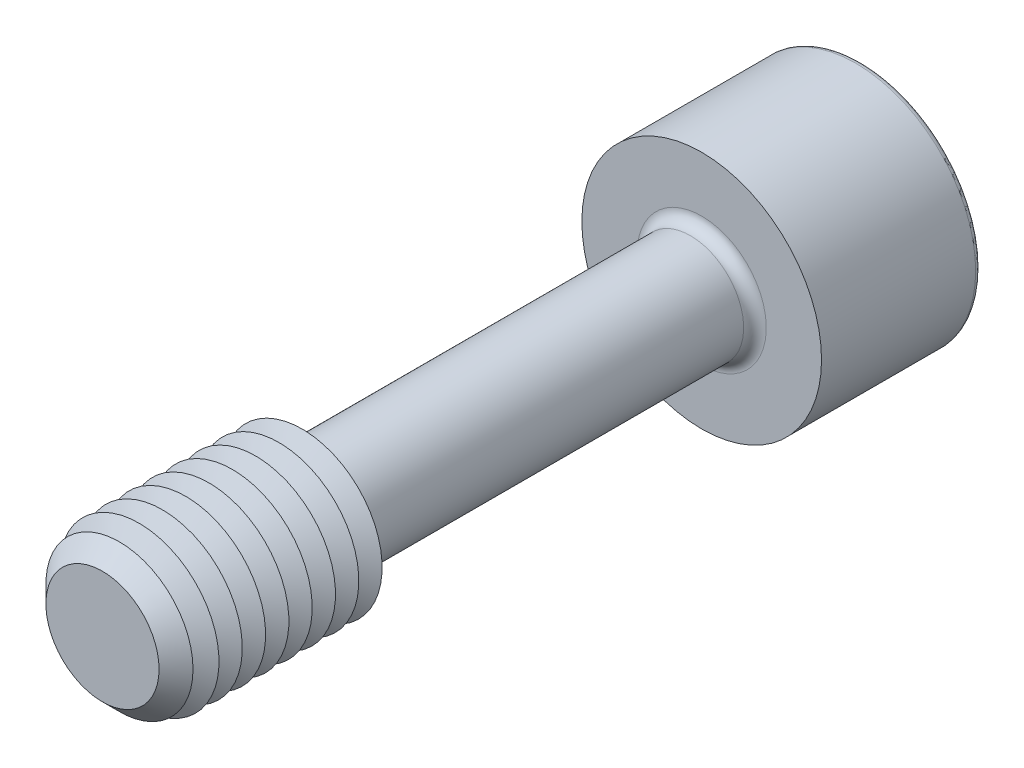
ISO-10303-21;
HEADER;
FILE_DESCRIPTION(('STEP AP214'),'2;1');
FILE_NAME('part.step','',(''),(''),'','','');
FILE_SCHEMA(('AUTOMOTIVE_DESIGN { 1 0 10303 214 1 1 1 1 }'));
ENDSEC;
DATA;
#1=APPLICATION_CONTEXT('core data for automotive mechanical design processes');
#2=APPLICATION_PROTOCOL_DEFINITION('international standard','automotive_design',2000,#1);
#3=PRODUCT_CONTEXT('',#1,'mechanical');
#4=PRODUCT('Part','Part','',(#3));
#5=PRODUCT_RELATED_PRODUCT_CATEGORY('part','',(#4));
#6=PRODUCT_DEFINITION_FORMATION('','',#4);
#7=PRODUCT_DEFINITION_CONTEXT('part definition',#1,'design');
#8=PRODUCT_DEFINITION('design','',#6,#7);
#9=PRODUCT_DEFINITION_SHAPE('','',#8);
#10=(LENGTH_UNIT() NAMED_UNIT(*) SI_UNIT(.MILLI.,.METRE.));
#11=(NAMED_UNIT(*) PLANE_ANGLE_UNIT() SI_UNIT($,.RADIAN.));
#12=(NAMED_UNIT(*) SI_UNIT($,.STERADIAN.) SOLID_ANGLE_UNIT());
#13=UNCERTAINTY_MEASURE_WITH_UNIT(LENGTH_MEASURE(1.E-05),#10,'distance_accuracy_value','');
#14=(GEOMETRIC_REPRESENTATION_CONTEXT(3) GLOBAL_UNCERTAINTY_ASSIGNED_CONTEXT((#13)) GLOBAL_UNIT_ASSIGNED_CONTEXT((#10,
#11,#12)) REPRESENTATION_CONTEXT('',''));
#15=CARTESIAN_POINT('',(0.,0.,0.));
#16=DIRECTION('',(0.,0.,1.));
#17=DIRECTION('',(1.,0.,0.));
#18=AXIS2_PLACEMENT_3D('',#15,#16,#17);
#19=CARTESIAN_POINT('',(-2.88675134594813,-5.,-24.5));
#20=DIRECTION('',(0.,0.,1.));
#21=DIRECTION('',(1.,0.,0.));
#22=AXIS2_PLACEMENT_3D('',#19,#20,#21);
#23=PLANE('',#22);
#24=DIRECTION('',(1.,0.,0.));
#25=VECTOR('',#24,1.);
#26=CARTESIAN_POINT('',(-2.88675134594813,-5.,-24.5));
#27=LINE('',#26,#25);
#28=CARTESIAN_POINT('',(0.,-5.,-24.5));
#29=VERTEX_POINT('',#28);
#30=CARTESIAN_POINT('',(2.88675134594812,-5.,-24.5));
#31=VERTEX_POINT('',#30);
#32=EDGE_CURVE('E760',#29,#31,#27,.T.);
#33=ORIENTED_EDGE('',*,*,#32,.F.);
#34=CARTESIAN_POINT('',(0.,0.,-24.5));
#35=DIRECTION('',(0.,0.,1.));
#36=DIRECTION('',(0.,-1.,0.));
#37=AXIS2_PLACEMENT_3D('',#34,#35,#36);
#38=CIRCLE('',#37,5.);
#39=CARTESIAN_POINT('',(4.3301270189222,-2.5,-24.5));
#40=VERTEX_POINT('',#39);
#41=EDGE_CURVE('E53',#29,#40,#38,.T.);
#42=ORIENTED_EDGE('',*,*,#41,.T.);
#43=DIRECTION('',(0.5,0.866025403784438,0.));
#44=VECTOR('',#43,1.);
#45=CARTESIAN_POINT('',(2.88675134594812,-5.,-24.5));
#46=LINE('',#45,#44);
#47=EDGE_CURVE('E745',#31,#40,#46,.T.);
#48=ORIENTED_EDGE('',*,*,#47,.F.);
#49=EDGE_LOOP('',(#33,#42,#48));
#50=FACE_BOUND('',#49,.T.);
#51=ADVANCED_FACE('F41',(#50),#23,.F.);
#52=CARTESIAN_POINT('',(5.77350269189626,0.,-24.5));
#53=VERTEX_POINT('',#52);
#54=EDGE_CURVE('E756',#40,#53,#46,.T.);
#55=ORIENTED_EDGE('',*,*,#54,.F.);
#56=CARTESIAN_POINT('',(4.3301270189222,2.50000000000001,-24.5));
#57=VERTEX_POINT('',#56);
#58=EDGE_CURVE('E11',#40,#57,#38,.T.);
#59=ORIENTED_EDGE('',*,*,#58,.T.);
#60=DIRECTION('',(-0.5,0.866025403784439,0.));
#61=VECTOR('',#60,1.);
#62=CARTESIAN_POINT('',(5.77350269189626,0.,-24.5));
#63=LINE('',#62,#61);
#64=EDGE_CURVE('E744',#53,#57,#63,.T.);
#65=ORIENTED_EDGE('',*,*,#64,.F.);
#66=EDGE_LOOP('',(#55,#59,#65));
#67=FACE_BOUND('',#66,.T.);
#68=ADVANCED_FACE('F133',(#67),#23,.F.);
#69=CARTESIAN_POINT('',(2.88675134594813,5.,-24.5));
#70=VERTEX_POINT('',#69);
#71=EDGE_CURVE('E740',#57,#70,#63,.T.);
#72=ORIENTED_EDGE('',*,*,#71,.F.);
#73=CARTESIAN_POINT('',(0.,5.00000000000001,-24.5));
#74=VERTEX_POINT('',#73);
#75=EDGE_CURVE('E51',#57,#74,#38,.T.);
#76=ORIENTED_EDGE('',*,*,#75,.T.);
#77=DIRECTION('',(-1.,0.,0.));
#78=VECTOR('',#77,1.);
#79=CARTESIAN_POINT('',(2.88675134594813,5.,-24.5));
#80=LINE('',#79,#78);
#81=EDGE_CURVE('E177',#70,#74,#80,.T.);
#82=ORIENTED_EDGE('',*,*,#81,.F.);
#83=EDGE_LOOP('',(#72,#76,#82));
#84=FACE_BOUND('',#83,.T.);
#85=ADVANCED_FACE('F139',(#84),#23,.F.);
#86=CARTESIAN_POINT('',(-2.88675134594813,5.,-24.5));
#87=VERTEX_POINT('',#86);
#88=EDGE_CURVE('E750',#74,#87,#80,.T.);
#89=ORIENTED_EDGE('',*,*,#88,.F.);
#90=CARTESIAN_POINT('',(-4.3301270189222,2.50000000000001,-24.5));
#91=VERTEX_POINT('',#90);
#92=EDGE_CURVE('E262',#74,#91,#38,.T.);
#93=ORIENTED_EDGE('',*,*,#92,.T.);
#94=DIRECTION('',(-0.5,-0.866025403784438,0.));
#95=VECTOR('',#94,1.);
#96=CARTESIAN_POINT('',(-2.88675134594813,5.,-24.5));
#97=LINE('',#96,#95);
#98=EDGE_CURVE('E176',#87,#91,#97,.T.);
#99=ORIENTED_EDGE('',*,*,#98,.F.);
#100=EDGE_LOOP('',(#89,#93,#99));
#101=FACE_BOUND('',#100,.T.);
#102=ADVANCED_FACE('F157',(#101),#23,.F.);
#103=CARTESIAN_POINT('',(-5.77350269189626,0.,-24.5));
#104=VERTEX_POINT('',#103);
#105=EDGE_CURVE('E170',#91,#104,#97,.T.);
#106=ORIENTED_EDGE('',*,*,#105,.F.);
#107=CARTESIAN_POINT('',(-4.3301270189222,-2.5,-24.5));
#108=VERTEX_POINT('',#107);
#109=EDGE_CURVE('E172',#91,#108,#38,.T.);
#110=ORIENTED_EDGE('',*,*,#109,.T.);
#111=DIRECTION('',(0.5,-0.866025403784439,0.));
#112=VECTOR('',#111,1.);
#113=CARTESIAN_POINT('',(-5.77350269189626,0.,-24.5));
#114=LINE('',#113,#112);
#115=EDGE_CURVE('E174',#104,#108,#114,.T.);
#116=ORIENTED_EDGE('',*,*,#115,.F.);
#117=EDGE_LOOP('',(#106,#110,#116));
#118=FACE_BOUND('',#117,.T.);
#119=ADVANCED_FACE('F146',(#118),#23,.F.);
#120=CARTESIAN_POINT('',(0.,0.,-34.5));
#121=DIRECTION('',(0.,0.,-1.));
#122=DIRECTION('',(-1.,0.,0.));
#123=AXIS2_PLACEMENT_3D('',#120,#121,#122);
#124=PLANE('',#123);
#125=CARTESIAN_POINT('',(0.,0.,-34.5));
#126=DIRECTION('',(0.,0.,-1.));
#127=DIRECTION('',(-1.,0.,0.));
#128=AXIS2_PLACEMENT_3D('',#125,#126,#127);
#129=CIRCLE('',#128,8.575);
#130=CARTESIAN_POINT('',(-8.575,0.,-34.5));
#131=VERTEX_POINT('',#130);
#132=EDGE_CURVE('E251',#131,#131,#129,.T.);
#133=ORIENTED_EDGE('',*,*,#132,.T.);
#134=EDGE_LOOP('',(#133));
#135=FACE_BOUND('',#134,.T.);
#136=DIRECTION('',(-0.5,-0.866025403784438,0.));
#137=VECTOR('',#136,1.);
#138=CARTESIAN_POINT('',(-2.88675134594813,5.,-34.5));
#139=LINE('',#138,#137);
#140=CARTESIAN_POINT('',(-2.88675134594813,5.,-34.5));
#141=VERTEX_POINT('',#140);
#142=CARTESIAN_POINT('',(-5.77350269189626,0.,-34.5));
#143=VERTEX_POINT('',#142);
#144=EDGE_CURVE('E212',#141,#143,#139,.T.);
#145=ORIENTED_EDGE('',*,*,#144,.T.);
#146=DIRECTION('',(0.5,-0.866025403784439,0.));
#147=VECTOR('',#146,1.);
#148=CARTESIAN_POINT('',(-5.77350269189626,0.,-34.5));
#149=LINE('',#148,#147);
#150=CARTESIAN_POINT('',(-2.88675134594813,-5.,-34.5));
#151=VERTEX_POINT('',#150);
#152=EDGE_CURVE('E67',#143,#151,#149,.T.);
#153=ORIENTED_EDGE('',*,*,#152,.T.);
#154=DIRECTION('',(1.,0.,0.));
#155=VECTOR('',#154,1.);
#156=CARTESIAN_POINT('',(-2.88675134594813,-5.,-34.5));
#157=LINE('',#156,#155);
#158=CARTESIAN_POINT('',(2.88675134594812,-5.,-34.5));
#159=VERTEX_POINT('',#158);
#160=EDGE_CURVE('E196',#151,#159,#157,.T.);
#161=ORIENTED_EDGE('',*,*,#160,.T.);
#162=DIRECTION('',(0.5,0.866025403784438,0.));
#163=VECTOR('',#162,1.);
#164=CARTESIAN_POINT('',(2.88675134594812,-5.,-34.5));
#165=LINE('',#164,#163);
#166=CARTESIAN_POINT('',(5.77350269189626,0.,-34.5));
#167=VERTEX_POINT('',#166);
#168=EDGE_CURVE('E200',#159,#167,#165,.T.);
#169=ORIENTED_EDGE('',*,*,#168,.T.);
#170=DIRECTION('',(-0.5,0.866025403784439,0.));
#171=VECTOR('',#170,1.);
#172=CARTESIAN_POINT('',(5.77350269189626,0.,-34.5));
#173=LINE('',#172,#171);
#174=CARTESIAN_POINT('',(2.88675134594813,5.,-34.5));
#175=VERTEX_POINT('',#174);
#176=EDGE_CURVE('E204',#167,#175,#173,.T.);
#177=ORIENTED_EDGE('',*,*,#176,.T.);
#178=DIRECTION('',(-1.,0.,0.));
#179=VECTOR('',#178,1.);
#180=CARTESIAN_POINT('',(2.88675134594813,5.,-34.5));
#181=LINE('',#180,#179);
#182=EDGE_CURVE('E208',#175,#141,#181,.T.);
#183=ORIENTED_EDGE('',*,*,#182,.T.);
#184=EDGE_LOOP('',(#145,#153,#161,#169,#177,#183));
#185=FACE_BOUND('',#184,.T.);
#186=ADVANCED_FACE('F156',(#135,#185),#124,.T.);
#187=CARTESIAN_POINT('',(0.,0.,22.5));
#188=DIRECTION('',(0.,0.,-1.));
#189=DIRECTION('',(-1.,0.,0.));
#190=AXIS2_PLACEMENT_3D('',#187,#188,#189);
#191=CYLINDRICAL_SURFACE('',#190,4.);
#192=CARTESIAN_POINT('',(0.,0.,-21.65));
#193=DIRECTION('',(0.,0.,-1.));
#194=DIRECTION('',(-1.,0.,0.));
#195=AXIS2_PLACEMENT_3D('',#192,#193,#194);
#196=CIRCLE('',#195,4.);
#197=CARTESIAN_POINT('',(-4.,0.,-21.65));
#198=VERTEX_POINT('',#197);
#199=EDGE_CURVE('E247',#198,#198,#196,.F.);
#200=CARTESIAN_POINT('',(0.,0.,6.34529946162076));
#201=DIRECTION('',(0.,0.,-1.));
#202=DIRECTION('',(0.,1.,0.));
#203=AXIS2_PLACEMENT_3D('',#200,#201,#202);
#204=CIRCLE('',#203,4.);
#205=CARTESIAN_POINT('',(-4.,0.,6.34529946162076));
#206=VERTEX_POINT('',#205);
#207=EDGE_CURVE('E235',#206,#206,#204,.T.);
#208=CARTESIAN_POINT('',(-4.,0.,-21.65));
#209=CARTESIAN_POINT('',(-4.,0.,-21.3583822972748));
#210=CARTESIAN_POINT('',(-4.,0.,-21.0667645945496));
#211=CARTESIAN_POINT('',(-4.,0.,-20.4835291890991));
#212=CARTESIAN_POINT('',(-4.,0.,-20.1919114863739));
#213=CARTESIAN_POINT('',(-4.,0.,-19.6086760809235));
#214=CARTESIAN_POINT('',(-4.,0.,-19.3170583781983));
#215=CARTESIAN_POINT('',(-4.,0.,-18.7338229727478));
#216=CARTESIAN_POINT('',(-4.,0.,-18.4422052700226));
#217=CARTESIAN_POINT('',(-4.,0.,-17.8589698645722));
#218=CARTESIAN_POINT('',(-4.,0.,-17.567352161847));
#219=CARTESIAN_POINT('',(-4.,0.,-16.9841167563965));
#220=CARTESIAN_POINT('',(-4.,0.,-16.6924990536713));
#221=CARTESIAN_POINT('',(-4.,0.,-16.1092636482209));
#222=CARTESIAN_POINT('',(-4.,0.,-15.8176459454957));
#223=CARTESIAN_POINT('',(-4.,0.,-15.2344105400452));
#224=CARTESIAN_POINT('',(-4.,0.,-14.94279283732));
#225=CARTESIAN_POINT('',(-4.,0.,-14.3595574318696));
#226=CARTESIAN_POINT('',(-4.,0.,-14.0679397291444));
#227=CARTESIAN_POINT('',(-4.,0.,-13.4847043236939));
#228=CARTESIAN_POINT('',(-4.,0.,-13.1930866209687));
#229=CARTESIAN_POINT('',(-4.,0.,-12.6098512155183));
#230=CARTESIAN_POINT('',(-4.,0.,-12.3182335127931));
#231=CARTESIAN_POINT('',(-4.,0.,-11.7349981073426));
#232=CARTESIAN_POINT('',(-4.,0.,-11.4433804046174));
#233=CARTESIAN_POINT('',(-4.,0.,-10.860144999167));
#234=CARTESIAN_POINT('',(-4.,0.,-10.5685272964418));
#235=CARTESIAN_POINT('',(-4.,0.,-9.98529189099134));
#236=CARTESIAN_POINT('',(-4.,0.,-9.69367418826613));
#237=CARTESIAN_POINT('',(-4.,0.,-9.1104387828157));
#238=CARTESIAN_POINT('',(-4.,0.,-8.81882108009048));
#239=CARTESIAN_POINT('',(-4.,0.,-8.23558567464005));
#240=CARTESIAN_POINT('',(-4.,0.,-7.94396797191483));
#241=CARTESIAN_POINT('',(-4.,0.,-7.3607325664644));
#242=CARTESIAN_POINT('',(-4.,0.,-7.06911486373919));
#243=CARTESIAN_POINT('',(-4.,0.,-6.48587945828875));
#244=CARTESIAN_POINT('',(-4.,0.,-6.19426175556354));
#245=CARTESIAN_POINT('',(-4.,0.,-5.6110263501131));
#246=CARTESIAN_POINT('',(-4.,0.,-5.31940864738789));
#247=CARTESIAN_POINT('',(-4.,0.,-4.73617324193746));
#248=CARTESIAN_POINT('',(-4.,0.,-4.44455553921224));
#249=CARTESIAN_POINT('',(-4.,0.,-3.86132013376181));
#250=CARTESIAN_POINT('',(-4.,0.,-3.56970243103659));
#251=CARTESIAN_POINT('',(-4.,0.,-2.98646702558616));
#252=CARTESIAN_POINT('',(-4.,0.,-2.69484932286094));
#253=CARTESIAN_POINT('',(-4.,0.,-2.11161391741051));
#254=CARTESIAN_POINT('',(-4.,0.,-1.81999621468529));
#255=CARTESIAN_POINT('',(-4.,0.,-1.23676080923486));
#256=CARTESIAN_POINT('',(-4.,0.,-0.945143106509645));
#257=CARTESIAN_POINT('',(-4.,0.,-0.361907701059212));
#258=CARTESIAN_POINT('',(-4.,0.,-0.0702899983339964));
#259=CARTESIAN_POINT('',(-4.,0.,0.512945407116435));
#260=CARTESIAN_POINT('',(-4.,0.,0.804563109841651));
#261=CARTESIAN_POINT('',(-4.,0.,1.38779851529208));
#262=CARTESIAN_POINT('',(-4.,0.,1.6794162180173));
#263=CARTESIAN_POINT('',(-4.,0.,2.26265162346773));
#264=CARTESIAN_POINT('',(-4.,0.,2.55426932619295));
#265=CARTESIAN_POINT('',(-4.,0.,3.13750473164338));
#266=CARTESIAN_POINT('',(-4.,0.,3.4291224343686));
#267=CARTESIAN_POINT('',(-4.,0.,4.01235783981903));
#268=CARTESIAN_POINT('',(-4.,0.,4.30397554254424));
#269=CARTESIAN_POINT('',(-4.,0.,4.88721094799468));
#270=CARTESIAN_POINT('',(-4.,0.,5.17882865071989));
#271=CARTESIAN_POINT('',(-4.,0.,5.76206405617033));
#272=CARTESIAN_POINT('',(-4.,0.,6.05368175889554));
#273=CARTESIAN_POINT('',(-4.,0.,6.34529946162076));
#274=B_SPLINE_CURVE_WITH_KNOTS('',3,(#208,#209,#210,#211,#212,#213,#214,#215,#216,#217,#218,
#219,#220,#221,#222,#223,#224,#225,#226,#227,#228,#229,#230,#231,#232,#233,#234,#235,#236,#237,
#238,#239,#240,#241,#242,#243,#244,#245,#246,#247,#248,#249,#250,#251,#252,#253,#254,#255,#256,
#257,#258,#259,#260,#261,#262,#263,#264,#265,#266,#267,#268,#269,#270,#271,#272,#273),
.UNSPECIFIED.,.F.,.F.,(4,2,2,2,2,2,2,2,2,2,2,2,2,2,2,2,2,2,2,2,2,2,2,2,2,2,2,2,2,2,2,2,4),(0.,
0.874853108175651,1.74970621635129,2.62455932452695,3.4994124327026,4.37426554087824,
5.24911864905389,6.12397175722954,6.99882486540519,7.87367797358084,8.74853108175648,
9.62338418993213,10.4982372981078,11.3730904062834,12.2479435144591,13.1227966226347,
13.9976497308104,14.872502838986,15.7473559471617,16.6222090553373,17.497062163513,
18.3719152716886,19.2467683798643,20.1216214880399,20.9964745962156,21.8713277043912,
22.7461808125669,23.6210339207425,24.4958870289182,25.3707401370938,26.2455932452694,
27.1204463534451,27.9952994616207),.UNSPECIFIED.);
#275=EDGE_CURVE('BSEAM163',#198,#206,#274,.T.);
#276=ORIENTED_EDGE('',*,*,#199,.T.);
#277=ORIENTED_EDGE('',*,*,#207,.T.);
#278=ORIENTED_EDGE('',*,*,#275,.T.);
#279=ORIENTED_EDGE('',*,*,#275,.F.);
#280=EDGE_LOOP('',(#276,#278,#277,#279));
#281=FACE_BOUND('',#280,.T.);
#282=ADVANCED_FACE('F163',(#281),#191,.T.);
#283=CARTESIAN_POINT('',(0.,0.,6.34529946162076));
#284=DIRECTION('',(0.,0.,1.));
#285=DIRECTION('',(0.,-1.,0.));
#286=AXIS2_PLACEMENT_3D('',#283,#284,#285);
#287=CONICAL_SURFACE('',#286,4.,1.0471975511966);
#288=CARTESIAN_POINT('',(0.,0.,7.5));
#289=DIRECTION('',(0.,0.,-1.));
#290=DIRECTION('',(-1.,0.,0.));
#291=AXIS2_PLACEMENT_3D('',#288,#289,#290);
#292=CIRCLE('',#291,6.);
#293=CARTESIAN_POINT('',(-6.,0.,7.5));
#294=VERTEX_POINT('',#293);
#295=EDGE_CURVE('E265',#294,#294,#292,.T.);
#296=ORIENTED_EDGE('',*,*,#295,.T.);
#297=EDGE_LOOP('',(#296));
#298=FACE_BOUND('',#297,.T.);
#299=ORIENTED_EDGE('',*,*,#207,.F.);
#300=EDGE_LOOP('',(#299));
#301=FACE_BOUND('',#300,.T.);
#302=ADVANCED_FACE('F509',(#298,#301),#287,.T.);
#303=CARTESIAN_POINT('',(0.,0.,-22.5));
#304=DIRECTION('',(0.,0.,-1.));
#305=DIRECTION('',(-1.,0.,0.));
#306=AXIS2_PLACEMENT_3D('',#303,#304,#305);
#307=PLANE('',#306);
#308=CARTESIAN_POINT('',(0.,0.,-22.5));
#309=DIRECTION('',(0.,0.,-1.));
#310=DIRECTION('',(-1.,0.,0.));
#311=AXIS2_PLACEMENT_3D('',#308,#309,#310);
#312=CIRCLE('',#311,4.85);
#313=CARTESIAN_POINT('',(-4.85,0.,-22.5));
#314=VERTEX_POINT('',#313);
#315=EDGE_CURVE('E243',#314,#314,#312,.T.);
#316=ORIENTED_EDGE('',*,*,#315,.T.);
#317=EDGE_LOOP('',(#316));
#318=FACE_BOUND('',#317,.T.);
#319=CARTESIAN_POINT('',(0.,0.,-22.5));
#320=DIRECTION('',(0.,0.,-1.));
#321=DIRECTION('',(-1.,0.,0.));
#322=AXIS2_PLACEMENT_3D('',#319,#320,#321);
#323=CIRCLE('',#322,9.);
#324=CARTESIAN_POINT('',(-9.,0.,-22.5));
#325=VERTEX_POINT('',#324);
#326=EDGE_CURVE('E231',#325,#325,#323,.T.);
#327=ORIENTED_EDGE('',*,*,#326,.F.);
#328=EDGE_LOOP('',(#327));
#329=FACE_BOUND('',#328,.T.);
#330=ADVANCED_FACE('F502',(#318,#329),#307,.F.);
#331=CARTESIAN_POINT('',(0.,0.,-34.5));
#332=DIRECTION('',(0.,0.,1.));
#333=DIRECTION('',(1.,0.,0.));
#334=AXIS2_PLACEMENT_3D('',#331,#332,#333);
#335=CYLINDRICAL_SURFACE('',#334,9.);
#336=CARTESIAN_POINT('',(0.,0.,-34.075));
#337=DIRECTION('',(0.,0.,-1.));
#338=DIRECTION('',(-1.,0.,0.));
#339=AXIS2_PLACEMENT_3D('',#336,#337,#338);
#340=CIRCLE('',#339,9.);
#341=CARTESIAN_POINT('',(-9.,0.,-34.075));
#342=VERTEX_POINT('',#341);
#343=EDGE_CURVE('E254',#342,#342,#340,.F.);
#344=ORIENTED_EDGE('',*,*,#343,.T.);
#345=EDGE_LOOP('',(#344));
#346=FACE_BOUND('',#345,.T.);
#347=ORIENTED_EDGE('',*,*,#326,.T.);
#348=EDGE_LOOP('',(#347));
#349=FACE_BOUND('',#348,.T.);
#350=ADVANCED_FACE('F508',(#346,#349),#335,.T.);
#351=CARTESIAN_POINT('',(-5.77350269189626,0.,-24.5));
#352=DIRECTION('',(0.866025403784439,0.5,0.));
#353=DIRECTION('',(-0.5,0.866025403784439,0.));
#354=AXIS2_PLACEMENT_3D('',#351,#352,#353);
#355=PLANE('',#354);
#356=ORIENTED_EDGE('',*,*,#152,.F.);
#357=DIRECTION('',(0.,0.,-1.));
#358=VECTOR('',#357,1.);
#359=CARTESIAN_POINT('',(-5.77350269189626,0.,-24.5));
#360=LINE('',#359,#358);
#361=EDGE_CURVE('E186',#104,#143,#360,.T.);
#362=ORIENTED_EDGE('',*,*,#361,.F.);
#363=ORIENTED_EDGE('',*,*,#115,.T.);
#364=CARTESIAN_POINT('',(-2.88675134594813,-5.,-24.5));
#365=VERTEX_POINT('',#364);
#366=EDGE_CURVE('E215',#108,#365,#114,.T.);
#367=ORIENTED_EDGE('',*,*,#366,.T.);
#368=DIRECTION('',(0.,0.,-1.));
#369=VECTOR('',#368,1.);
#370=CARTESIAN_POINT('',(-2.88675134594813,-5.,-24.5));
#371=LINE('',#370,#369);
#372=EDGE_CURVE('E228',#365,#151,#371,.T.);
#373=ORIENTED_EDGE('',*,*,#372,.T.);
#374=EDGE_LOOP('',(#356,#362,#363,#367,#373));
#375=FACE_BOUND('',#374,.T.);
#376=ADVANCED_FACE('F520',(#375),#355,.T.);
#377=CARTESIAN_POINT('',(-2.88675134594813,-5.,-24.5));
#378=DIRECTION('',(0.,1.,0.));
#379=DIRECTION('',(0.,0.,1.));
#380=AXIS2_PLACEMENT_3D('',#377,#378,#379);
#381=PLANE('',#380);
#382=ORIENTED_EDGE('',*,*,#160,.F.);
#383=ORIENTED_EDGE('',*,*,#372,.F.);
#384=EDGE_CURVE('E757',#365,#29,#27,.T.);
#385=ORIENTED_EDGE('',*,*,#384,.T.);
#386=ORIENTED_EDGE('',*,*,#32,.T.);
#387=DIRECTION('',(0.,0.,-1.));
#388=VECTOR('',#387,1.);
#389=CARTESIAN_POINT('',(2.88675134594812,-5.,-24.5));
#390=LINE('',#389,#388);
#391=EDGE_CURVE('E225',#31,#159,#390,.T.);
#392=ORIENTED_EDGE('',*,*,#391,.T.);
#393=EDGE_LOOP('',(#382,#383,#385,#386,#392));
#394=FACE_BOUND('',#393,.T.);
#395=ADVANCED_FACE('F536',(#394),#381,.T.);
#396=CARTESIAN_POINT('',(2.88675134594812,-5.,-24.5));
#397=DIRECTION('',(-0.866025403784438,0.5,0.));
#398=DIRECTION('',(-0.5,-0.866025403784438,0.));
#399=AXIS2_PLACEMENT_3D('',#396,#397,#398);
#400=PLANE('',#399);
#401=ORIENTED_EDGE('',*,*,#168,.F.);
#402=ORIENTED_EDGE('',*,*,#391,.F.);
#403=ORIENTED_EDGE('',*,*,#47,.T.);
#404=ORIENTED_EDGE('',*,*,#54,.T.);
#405=DIRECTION('',(0.,0.,-1.));
#406=VECTOR('',#405,1.);
#407=CARTESIAN_POINT('',(5.77350269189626,0.,-24.5));
#408=LINE('',#407,#406);
#409=EDGE_CURVE('E222',#53,#167,#408,.T.);
#410=ORIENTED_EDGE('',*,*,#409,.T.);
#411=EDGE_LOOP('',(#401,#402,#403,#404,#410));
#412=FACE_BOUND('',#411,.T.);
#413=ADVANCED_FACE('F546',(#412),#400,.T.);
#414=CARTESIAN_POINT('',(5.77350269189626,0.,-24.5));
#415=DIRECTION('',(-0.866025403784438,-0.5,0.));
#416=DIRECTION('',(0.5,-0.866025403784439,0.));
#417=AXIS2_PLACEMENT_3D('',#414,#415,#416);
#418=PLANE('',#417);
#419=ORIENTED_EDGE('',*,*,#176,.F.);
#420=ORIENTED_EDGE('',*,*,#409,.F.);
#421=ORIENTED_EDGE('',*,*,#64,.T.);
#422=ORIENTED_EDGE('',*,*,#71,.T.);
#423=DIRECTION('',(0.,0.,-1.));
#424=VECTOR('',#423,1.);
#425=CARTESIAN_POINT('',(2.88675134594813,5.,-24.5));
#426=LINE('',#425,#424);
#427=EDGE_CURVE('E219',#70,#175,#426,.T.);
#428=ORIENTED_EDGE('',*,*,#427,.T.);
#429=EDGE_LOOP('',(#419,#420,#421,#422,#428));
#430=FACE_BOUND('',#429,.T.);
#431=ADVANCED_FACE('F556',(#430),#418,.T.);
#432=CARTESIAN_POINT('',(2.88675134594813,5.,-24.5));
#433=DIRECTION('',(0.,-1.,0.));
#434=DIRECTION('',(0.,0.,-1.));
#435=AXIS2_PLACEMENT_3D('',#432,#433,#434);
#436=PLANE('',#435);
#437=ORIENTED_EDGE('',*,*,#182,.F.);
#438=ORIENTED_EDGE('',*,*,#427,.F.);
#439=ORIENTED_EDGE('',*,*,#81,.T.);
#440=ORIENTED_EDGE('',*,*,#88,.T.);
#441=DIRECTION('',(0.,0.,-1.));
#442=VECTOR('',#441,1.);
#443=CARTESIAN_POINT('',(-2.88675134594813,5.,-24.5));
#444=LINE('',#443,#442);
#445=EDGE_CURVE('E182',#87,#141,#444,.T.);
#446=ORIENTED_EDGE('',*,*,#445,.T.);
#447=EDGE_LOOP('',(#437,#438,#439,#440,#446));
#448=FACE_BOUND('',#447,.T.);
#449=ADVANCED_FACE('F152',(#448),#436,.T.);
#450=CARTESIAN_POINT('',(-2.88675134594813,5.,-24.5));
#451=DIRECTION('',(0.866025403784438,-0.5,0.));
#452=DIRECTION('',(0.5,0.866025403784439,0.));
#453=AXIS2_PLACEMENT_3D('',#450,#451,#452);
#454=PLANE('',#453);
#455=ORIENTED_EDGE('',*,*,#144,.F.);
#456=ORIENTED_EDGE('',*,*,#445,.F.);
#457=ORIENTED_EDGE('',*,*,#98,.T.);
#458=ORIENTED_EDGE('',*,*,#105,.T.);
#459=ORIENTED_EDGE('',*,*,#361,.T.);
#460=EDGE_LOOP('',(#455,#456,#457,#458,#459));
#461=FACE_BOUND('',#460,.T.);
#462=ADVANCED_FACE('F144',(#461),#454,.T.);
#463=ORIENTED_EDGE('',*,*,#366,.F.);
#464=EDGE_CURVE('E257',#108,#29,#38,.T.);
#465=ORIENTED_EDGE('',*,*,#464,.T.);
#466=ORIENTED_EDGE('',*,*,#384,.F.);
#467=EDGE_LOOP('',(#463,#465,#466));
#468=FACE_BOUND('',#467,.T.);
#469=ADVANCED_FACE('F135',(#468),#23,.F.);
#470=CARTESIAN_POINT('',(0.,0.,-21.65));
#471=DIRECTION('',(0.,0.,-1.));
#472=DIRECTION('',(-1.,0.,0.));
#473=AXIS2_PLACEMENT_3D('',#470,#471,#472);
#474=TOROIDAL_SURFACE('',#473,4.85,0.85);
#475=ORIENTED_EDGE('',*,*,#199,.F.);
#476=EDGE_LOOP('',(#475));
#477=FACE_BOUND('',#476,.T.);
#478=ORIENTED_EDGE('',*,*,#315,.F.);
#479=EDGE_LOOP('',(#478));
#480=FACE_BOUND('',#479,.T.);
#481=ADVANCED_FACE('F129',(#477,#480),#474,.F.);
#482=CARTESIAN_POINT('',(0.,0.,-34.075));
#483=DIRECTION('',(0.,0.,-1.));
#484=DIRECTION('',(-1.,0.,0.));
#485=AXIS2_PLACEMENT_3D('',#482,#483,#484);
#486=TOROIDAL_SURFACE('',#485,8.575,0.425);
#487=ORIENTED_EDGE('',*,*,#343,.F.);
#488=EDGE_LOOP('',(#487));
#489=FACE_BOUND('',#488,.T.);
#490=ORIENTED_EDGE('',*,*,#132,.F.);
#491=EDGE_LOOP('',(#490));
#492=FACE_BOUND('',#491,.T.);
#493=ADVANCED_FACE('F43',(#489,#492),#486,.T.);
#494=CARTESIAN_POINT('',(0.,0.,-21.6132486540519));
#495=DIRECTION('',(0.,0.,-1.));
#496=DIRECTION('',(0.,1.,0.));
#497=AXIS2_PLACEMENT_3D('',#494,#495,#496);
#498=CONICAL_SURFACE('',#497,0.,1.04719755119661);
#499=ORIENTED_EDGE('',*,*,#41,.F.);
#500=ORIENTED_EDGE('',*,*,#464,.F.);
#501=ORIENTED_EDGE('',*,*,#109,.F.);
#502=ORIENTED_EDGE('',*,*,#92,.F.);
#503=ORIENTED_EDGE('',*,*,#75,.F.);
#504=ORIENTED_EDGE('',*,*,#58,.F.);
#505=EDGE_LOOP('',(#499,#500,#501,#502,#503,#504));
#506=FACE_BOUND('',#505,.T.);
#507=CARTESIAN_POINT('',(0.,0.,-21.6132486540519));
#508=VERTEX_POINT('',#507);
#509=VERTEX_LOOP('',#508);
#510=FACE_BOUND('',#509,.T.);
#511=ADVANCED_FACE('F118',(#506,#510),#498,.F.);
#512=CARTESIAN_POINT('',(0.,0.,8.375));
#513=DIRECTION('',(0.,0.,-1.));
#514=DIRECTION('',(-1.,0.,0.));
#515=AXIS2_PLACEMENT_3D('',#512,#513,#514);
#516=CONICAL_SURFACE('',#515,4.48445554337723,1.0471975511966);
#517=ORIENTED_EDGE('',*,*,#295,.F.);
#518=EDGE_LOOP('',(#517));
#519=FACE_BOUND('',#518,.T.);
#520=CARTESIAN_POINT('',(0.,0.,8.375));
#521=DIRECTION('',(0.,0.,-1.));
#522=DIRECTION('',(-1.,0.,0.));
#523=AXIS2_PLACEMENT_3D('',#520,#521,#522);
#524=CIRCLE('',#523,4.48445554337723);
#525=CARTESIAN_POINT('',(-4.48445554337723,0.,8.375));
#526=VERTEX_POINT('',#525);
#527=EDGE_CURVE('E271',#526,#526,#524,.T.);
#528=ORIENTED_EDGE('',*,*,#527,.T.);
#529=EDGE_LOOP('',(#528));
#530=FACE_BOUND('',#529,.T.);
#531=ADVANCED_FACE('F120',(#519,#530),#516,.T.);
#532=CARTESIAN_POINT('',(0.,0.,9.25));
#533=DIRECTION('',(0.,0.,1.));
#534=DIRECTION('',(1.,0.,0.));
#535=AXIS2_PLACEMENT_3D('',#532,#533,#534);
#536=CONICAL_SURFACE('',#535,6.,1.0471975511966);
#537=ORIENTED_EDGE('',*,*,#527,.F.);
#538=EDGE_LOOP('',(#537));
#539=FACE_BOUND('',#538,.T.);
#540=CARTESIAN_POINT('',(0.,0.,9.25));
#541=DIRECTION('',(0.,0.,-1.));
#542=DIRECTION('',(-1.,0.,0.));
#543=AXIS2_PLACEMENT_3D('',#540,#541,#542);
#544=CIRCLE('',#543,6.);
#545=CARTESIAN_POINT('',(-6.,0.,9.25));
#546=VERTEX_POINT('',#545);
#547=EDGE_CURVE('E277',#546,#546,#544,.T.);
#548=ORIENTED_EDGE('',*,*,#547,.T.);
#549=EDGE_LOOP('',(#548));
#550=FACE_BOUND('',#549,.T.);
#551=ADVANCED_FACE('F126',(#539,#550),#536,.T.);
#552=CARTESIAN_POINT('',(0.,0.,10.125));
#553=DIRECTION('',(0.,0.,-1.));
#554=DIRECTION('',(-1.,0.,0.));
#555=AXIS2_PLACEMENT_3D('',#552,#553,#554);
#556=CONICAL_SURFACE('',#555,4.48445554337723,1.0471975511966);
#557=ORIENTED_EDGE('',*,*,#547,.F.);
#558=EDGE_LOOP('',(#557));
#559=FACE_BOUND('',#558,.T.);
#560=CARTESIAN_POINT('',(0.,0.,10.125));
#561=DIRECTION('',(0.,0.,-1.));
#562=DIRECTION('',(-1.,0.,0.));
#563=AXIS2_PLACEMENT_3D('',#560,#561,#562);
#564=CIRCLE('',#563,4.48445554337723);
#565=CARTESIAN_POINT('',(-4.48445554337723,0.,10.125));
#566=VERTEX_POINT('',#565);
#567=EDGE_CURVE('E283',#566,#566,#564,.T.);
#568=ORIENTED_EDGE('',*,*,#567,.T.);
#569=EDGE_LOOP('',(#568));
#570=FACE_BOUND('',#569,.T.);
#571=ADVANCED_FACE('F396',(#559,#570),#556,.T.);
#572=CARTESIAN_POINT('',(0.,0.,11.));
#573=DIRECTION('',(0.,0.,1.));
#574=DIRECTION('',(1.,0.,0.));
#575=AXIS2_PLACEMENT_3D('',#572,#573,#574);
#576=CONICAL_SURFACE('',#575,6.,1.0471975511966);
#577=ORIENTED_EDGE('',*,*,#567,.F.);
#578=EDGE_LOOP('',(#577));
#579=FACE_BOUND('',#578,.T.);
#580=CARTESIAN_POINT('',(0.,0.,11.));
#581=DIRECTION('',(0.,0.,-1.));
#582=DIRECTION('',(-1.,0.,0.));
#583=AXIS2_PLACEMENT_3D('',#580,#581,#582);
#584=CIRCLE('',#583,6.);
#585=CARTESIAN_POINT('',(-6.,0.,11.));
#586=VERTEX_POINT('',#585);
#587=EDGE_CURVE('E287',#586,#586,#584,.T.);
#588=ORIENTED_EDGE('',*,*,#587,.T.);
#589=EDGE_LOOP('',(#588));
#590=FACE_BOUND('',#589,.T.);
#591=ADVANCED_FACE('F392',(#579,#590),#576,.T.);
#592=CARTESIAN_POINT('',(0.,0.,11.875));
#593=DIRECTION('',(0.,0.,-1.));
#594=DIRECTION('',(-1.,0.,0.));
#595=AXIS2_PLACEMENT_3D('',#592,#593,#594);
#596=CONICAL_SURFACE('',#595,4.48445554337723,1.0471975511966);
#597=ORIENTED_EDGE('',*,*,#587,.F.);
#598=EDGE_LOOP('',(#597));
#599=FACE_BOUND('',#598,.T.);
#600=CARTESIAN_POINT('',(0.,0.,11.875));
#601=DIRECTION('',(0.,0.,-1.));
#602=DIRECTION('',(-1.,0.,0.));
#603=AXIS2_PLACEMENT_3D('',#600,#601,#602);
#604=CIRCLE('',#603,4.48445554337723);
#605=CARTESIAN_POINT('',(-4.48445554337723,0.,11.875));
#606=VERTEX_POINT('',#605);
#607=EDGE_CURVE('E290',#606,#606,#604,.T.);
#608=ORIENTED_EDGE('',*,*,#607,.T.);
#609=EDGE_LOOP('',(#608));
#610=FACE_BOUND('',#609,.T.);
#611=ADVANCED_FACE('F388',(#599,#610),#596,.T.);
#612=CARTESIAN_POINT('',(0.,0.,12.75));
#613=DIRECTION('',(0.,0.,1.));
#614=DIRECTION('',(1.,0.,0.));
#615=AXIS2_PLACEMENT_3D('',#612,#613,#614);
#616=CONICAL_SURFACE('',#615,6.,1.0471975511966);
#617=ORIENTED_EDGE('',*,*,#607,.F.);
#618=EDGE_LOOP('',(#617));
#619=FACE_BOUND('',#618,.T.);
#620=CARTESIAN_POINT('',(0.,0.,12.75));
#621=DIRECTION('',(0.,0.,-1.));
#622=DIRECTION('',(-1.,0.,0.));
#623=AXIS2_PLACEMENT_3D('',#620,#621,#622);
#624=CIRCLE('',#623,6.);
#625=CARTESIAN_POINT('',(-6.,0.,12.75));
#626=VERTEX_POINT('',#625);
#627=EDGE_CURVE('E294',#626,#626,#624,.T.);
#628=ORIENTED_EDGE('',*,*,#627,.T.);
#629=EDGE_LOOP('',(#628));
#630=FACE_BOUND('',#629,.T.);
#631=ADVANCED_FACE('F384',(#619,#630),#616,.T.);
#632=CARTESIAN_POINT('',(0.,0.,13.625));
#633=DIRECTION('',(0.,0.,-1.));
#634=DIRECTION('',(-1.,0.,0.));
#635=AXIS2_PLACEMENT_3D('',#632,#633,#634);
#636=CONICAL_SURFACE('',#635,4.48445554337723,1.0471975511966);
#637=ORIENTED_EDGE('',*,*,#627,.F.);
#638=EDGE_LOOP('',(#637));
#639=FACE_BOUND('',#638,.T.);
#640=CARTESIAN_POINT('',(0.,0.,13.625));
#641=DIRECTION('',(0.,0.,-1.));
#642=DIRECTION('',(-1.,0.,0.));
#643=AXIS2_PLACEMENT_3D('',#640,#641,#642);
#644=CIRCLE('',#643,4.48445554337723);
#645=CARTESIAN_POINT('',(-4.48445554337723,0.,13.625));
#646=VERTEX_POINT('',#645);
#647=EDGE_CURVE('E298',#646,#646,#644,.T.);
#648=ORIENTED_EDGE('',*,*,#647,.T.);
#649=EDGE_LOOP('',(#648));
#650=FACE_BOUND('',#649,.T.);
#651=ADVANCED_FACE('F380',(#639,#650),#636,.T.);
#652=CARTESIAN_POINT('',(0.,0.,14.5));
#653=DIRECTION('',(0.,0.,1.));
#654=DIRECTION('',(1.,0.,0.));
#655=AXIS2_PLACEMENT_3D('',#652,#653,#654);
#656=CONICAL_SURFACE('',#655,6.,1.0471975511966);
#657=ORIENTED_EDGE('',*,*,#647,.F.);
#658=EDGE_LOOP('',(#657));
#659=FACE_BOUND('',#658,.T.);
#660=CARTESIAN_POINT('',(0.,0.,14.5));
#661=DIRECTION('',(0.,0.,-1.));
#662=DIRECTION('',(-1.,0.,0.));
#663=AXIS2_PLACEMENT_3D('',#660,#661,#662);
#664=CIRCLE('',#663,6.);
#665=CARTESIAN_POINT('',(-6.,0.,14.5));
#666=VERTEX_POINT('',#665);
#667=EDGE_CURVE('E302',#666,#666,#664,.T.);
#668=ORIENTED_EDGE('',*,*,#667,.T.);
#669=EDGE_LOOP('',(#668));
#670=FACE_BOUND('',#669,.T.);
#671=ADVANCED_FACE('F376',(#659,#670),#656,.T.);
#672=CARTESIAN_POINT('',(0.,0.,15.375));
#673=DIRECTION('',(0.,0.,-1.));
#674=DIRECTION('',(-1.,0.,0.));
#675=AXIS2_PLACEMENT_3D('',#672,#673,#674);
#676=CONICAL_SURFACE('',#675,4.48445554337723,1.0471975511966);
#677=ORIENTED_EDGE('',*,*,#667,.F.);
#678=EDGE_LOOP('',(#677));
#679=FACE_BOUND('',#678,.T.);
#680=CARTESIAN_POINT('',(0.,0.,15.375));
#681=DIRECTION('',(0.,0.,-1.));
#682=DIRECTION('',(-1.,0.,0.));
#683=AXIS2_PLACEMENT_3D('',#680,#681,#682);
#684=CIRCLE('',#683,4.48445554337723);
#685=CARTESIAN_POINT('',(-4.48445554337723,0.,15.375));
#686=VERTEX_POINT('',#685);
#687=EDGE_CURVE('E306',#686,#686,#684,.T.);
#688=ORIENTED_EDGE('',*,*,#687,.T.);
#689=EDGE_LOOP('',(#688));
#690=FACE_BOUND('',#689,.T.);
#691=ADVANCED_FACE('F372',(#679,#690),#676,.T.);
#692=CARTESIAN_POINT('',(0.,0.,16.25));
#693=DIRECTION('',(0.,0.,1.));
#694=DIRECTION('',(1.,0.,0.));
#695=AXIS2_PLACEMENT_3D('',#692,#693,#694);
#696=CONICAL_SURFACE('',#695,6.,1.0471975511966);
#697=ORIENTED_EDGE('',*,*,#687,.F.);
#698=EDGE_LOOP('',(#697));
#699=FACE_BOUND('',#698,.T.);
#700=CARTESIAN_POINT('',(0.,0.,16.25));
#701=DIRECTION('',(0.,0.,-1.));
#702=DIRECTION('',(-1.,0.,0.));
#703=AXIS2_PLACEMENT_3D('',#700,#701,#702);
#704=CIRCLE('',#703,6.);
#705=CARTESIAN_POINT('',(-6.,0.,16.25));
#706=VERTEX_POINT('',#705);
#707=EDGE_CURVE('E310',#706,#706,#704,.T.);
#708=ORIENTED_EDGE('',*,*,#707,.T.);
#709=EDGE_LOOP('',(#708));
#710=FACE_BOUND('',#709,.T.);
#711=ADVANCED_FACE('F368',(#699,#710),#696,.T.);
#712=CARTESIAN_POINT('',(0.,0.,17.125));
#713=DIRECTION('',(0.,0.,-1.));
#714=DIRECTION('',(-1.,0.,0.));
#715=AXIS2_PLACEMENT_3D('',#712,#713,#714);
#716=CONICAL_SURFACE('',#715,4.48445554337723,1.0471975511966);
#717=ORIENTED_EDGE('',*,*,#707,.F.);
#718=EDGE_LOOP('',(#717));
#719=FACE_BOUND('',#718,.T.);
#720=CARTESIAN_POINT('',(0.,0.,17.125));
#721=DIRECTION('',(0.,0.,-1.));
#722=DIRECTION('',(-1.,0.,0.));
#723=AXIS2_PLACEMENT_3D('',#720,#721,#722);
#724=CIRCLE('',#723,4.48445554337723);
#725=CARTESIAN_POINT('',(-4.48445554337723,0.,17.125));
#726=VERTEX_POINT('',#725);
#727=EDGE_CURVE('E314',#726,#726,#724,.T.);
#728=ORIENTED_EDGE('',*,*,#727,.T.);
#729=EDGE_LOOP('',(#728));
#730=FACE_BOUND('',#729,.T.);
#731=ADVANCED_FACE('F364',(#719,#730),#716,.T.);
#732=CARTESIAN_POINT('',(0.,0.,18.));
#733=DIRECTION('',(0.,0.,1.));
#734=DIRECTION('',(1.,0.,0.));
#735=AXIS2_PLACEMENT_3D('',#732,#733,#734);
#736=CONICAL_SURFACE('',#735,6.,1.0471975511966);
#737=ORIENTED_EDGE('',*,*,#727,.F.);
#738=EDGE_LOOP('',(#737));
#739=FACE_BOUND('',#738,.T.);
#740=CARTESIAN_POINT('',(0.,0.,18.));
#741=DIRECTION('',(0.,0.,-1.));
#742=DIRECTION('',(-1.,0.,0.));
#743=AXIS2_PLACEMENT_3D('',#740,#741,#742);
#744=CIRCLE('',#743,6.);
#745=CARTESIAN_POINT('',(-6.,0.,18.));
#746=VERTEX_POINT('',#745);
#747=EDGE_CURVE('E318',#746,#746,#744,.T.);
#748=ORIENTED_EDGE('',*,*,#747,.T.);
#749=EDGE_LOOP('',(#748));
#750=FACE_BOUND('',#749,.T.);
#751=ADVANCED_FACE('F360',(#739,#750),#736,.T.);
#752=CARTESIAN_POINT('',(0.,0.,18.875));
#753=DIRECTION('',(0.,0.,-1.));
#754=DIRECTION('',(-1.,0.,0.));
#755=AXIS2_PLACEMENT_3D('',#752,#753,#754);
#756=CONICAL_SURFACE('',#755,4.48445554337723,1.0471975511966);
#757=ORIENTED_EDGE('',*,*,#747,.F.);
#758=EDGE_LOOP('',(#757));
#759=FACE_BOUND('',#758,.T.);
#760=CARTESIAN_POINT('',(0.,0.,18.875));
#761=DIRECTION('',(0.,0.,-1.));
#762=DIRECTION('',(-1.,0.,0.));
#763=AXIS2_PLACEMENT_3D('',#760,#761,#762);
#764=CIRCLE('',#763,4.48445554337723);
#765=CARTESIAN_POINT('',(-4.48445554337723,0.,18.875));
#766=VERTEX_POINT('',#765);
#767=EDGE_CURVE('E322',#766,#766,#764,.T.);
#768=ORIENTED_EDGE('',*,*,#767,.T.);
#769=EDGE_LOOP('',(#768));
#770=FACE_BOUND('',#769,.T.);
#771=ADVANCED_FACE('F356',(#759,#770),#756,.T.);
#772=CARTESIAN_POINT('',(0.,0.,19.75));
#773=DIRECTION('',(0.,0.,1.));
#774=DIRECTION('',(1.,0.,0.));
#775=AXIS2_PLACEMENT_3D('',#772,#773,#774);
#776=CONICAL_SURFACE('',#775,6.,1.0471975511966);
#777=ORIENTED_EDGE('',*,*,#767,.F.);
#778=EDGE_LOOP('',(#777));
#779=FACE_BOUND('',#778,.T.);
#780=CARTESIAN_POINT('',(0.,0.,19.75));
#781=DIRECTION('',(0.,0.,-1.));
#782=DIRECTION('',(-1.,0.,0.));
#783=AXIS2_PLACEMENT_3D('',#780,#781,#782);
#784=CIRCLE('',#783,6.);
#785=CARTESIAN_POINT('',(-6.,0.,19.75));
#786=VERTEX_POINT('',#785);
#787=EDGE_CURVE('E326',#786,#786,#784,.T.);
#788=ORIENTED_EDGE('',*,*,#787,.T.);
#789=EDGE_LOOP('',(#788));
#790=FACE_BOUND('',#789,.T.);
#791=ADVANCED_FACE('F349',(#779,#790),#776,.T.);
#792=CARTESIAN_POINT('',(0.,0.,20.625));
#793=DIRECTION('',(0.,0.,-1.));
#794=DIRECTION('',(-1.,0.,0.));
#795=AXIS2_PLACEMENT_3D('',#792,#793,#794);
#796=CONICAL_SURFACE('',#795,4.48445554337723,1.0471975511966);
#797=ORIENTED_EDGE('',*,*,#787,.F.);
#798=EDGE_LOOP('',(#797));
#799=FACE_BOUND('',#798,.T.);
#800=CARTESIAN_POINT('',(0.,0.,20.625));
#801=DIRECTION('',(0.,0.,-1.));
#802=DIRECTION('',(-1.,0.,0.));
#803=AXIS2_PLACEMENT_3D('',#800,#801,#802);
#804=CIRCLE('',#803,4.48445554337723);
#805=CARTESIAN_POINT('',(-4.48445554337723,0.,20.625));
#806=VERTEX_POINT('',#805);
#807=EDGE_CURVE('E330',#806,#806,#804,.T.);
#808=ORIENTED_EDGE('',*,*,#807,.T.);
#809=EDGE_LOOP('',(#808));
#810=FACE_BOUND('',#809,.T.);
#811=ADVANCED_FACE('F335',(#799,#810),#796,.T.);
#812=CARTESIAN_POINT('',(0.,0.,21.5));
#813=DIRECTION('',(0.,0.,1.));
#814=DIRECTION('',(1.,0.,0.));
#815=AXIS2_PLACEMENT_3D('',#812,#813,#814);
#816=CONICAL_SURFACE('',#815,6.,1.0471975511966);
#817=CARTESIAN_POINT('',(0.,0.,21.2254809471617));
#818=DIRECTION('',(0.,0.,1.));
#819=DIRECTION('',(1.,0.,0.));
#820=AXIS2_PLACEMENT_3D('',#817,#818,#819);
#821=CIRCLE('',#820,5.52451905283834);
#822=CARTESIAN_POINT('',(5.52451905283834,0.,21.2254809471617));
#823=VERTEX_POINT('',#822);
#824=EDGE_CURVE('E45',#823,#823,#821,.F.);
#825=ORIENTED_EDGE('',*,*,#824,.T.);
#826=EDGE_LOOP('',(#825));
#827=FACE_BOUND('',#826,.T.);
#828=ORIENTED_EDGE('',*,*,#807,.F.);
#829=EDGE_LOOP('',(#828));
#830=FACE_BOUND('',#829,.T.);
#831=ADVANCED_FACE('F337',(#827,#830),#816,.T.);
#832=CARTESIAN_POINT('',(0.,0.,22.5));
#833=DIRECTION('',(0.,0.,1.));
#834=DIRECTION('',(1.,0.,0.));
#835=AXIS2_PLACEMENT_3D('',#832,#833,#834);
#836=PLANE('',#835);
#837=CARTESIAN_POINT('',(0.,0.,22.5));
#838=DIRECTION('',(0.,0.,1.));
#839=DIRECTION('',(1.,0.,0.));
#840=AXIS2_PLACEMENT_3D('',#837,#838,#839);
#841=CIRCLE('',#840,4.25000000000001);
#842=CARTESIAN_POINT('',(4.25000000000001,0.,22.5));
#843=VERTEX_POINT('',#842);
#844=EDGE_CURVE('E239',#843,#843,#841,.T.);
#845=ORIENTED_EDGE('',*,*,#844,.T.);
#846=EDGE_LOOP('',(#845));
#847=FACE_BOUND('',#846,.T.);
#848=ADVANCED_FACE('F339',(#847),#836,.T.);
#849=CARTESIAN_POINT('',(0.,0.,20.75));
#850=DIRECTION('',(0.,0.,-1.));
#851=DIRECTION('',(0.,1.,0.));
#852=AXIS2_PLACEMENT_3D('',#849,#850,#851);
#853=CONICAL_SURFACE('',#852,6.,0.78539816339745);
#854=ORIENTED_EDGE('',*,*,#824,.F.);
#855=EDGE_LOOP('',(#854));
#856=FACE_BOUND('',#855,.T.);
#857=ORIENTED_EDGE('',*,*,#844,.F.);
#858=EDGE_LOOP('',(#857));
#859=FACE_BOUND('',#858,.T.);
#860=ADVANCED_FACE('F346',(#856,#859),#853,.T.);
#861=CLOSED_SHELL('',(#51,#68,#85,#102,#119,#186,#282,#302,#330,#350,#376,#395,#413,#431,#449,
#462,#469,#481,#493,#511,#531,#551,#571,#591,#611,#631,#651,#671,#691,#711,#731,#751,#771,#791,
#811,#831,#848,#860));
#862=MANIFOLD_SOLID_BREP('B2',#861);
#863=ADVANCED_BREP_SHAPE_REPRESENTATION('',(#18,#862),#14);
#864=SHAPE_DEFINITION_REPRESENTATION(#9,#863);
ENDSEC;
END-ISO-10303-21;
